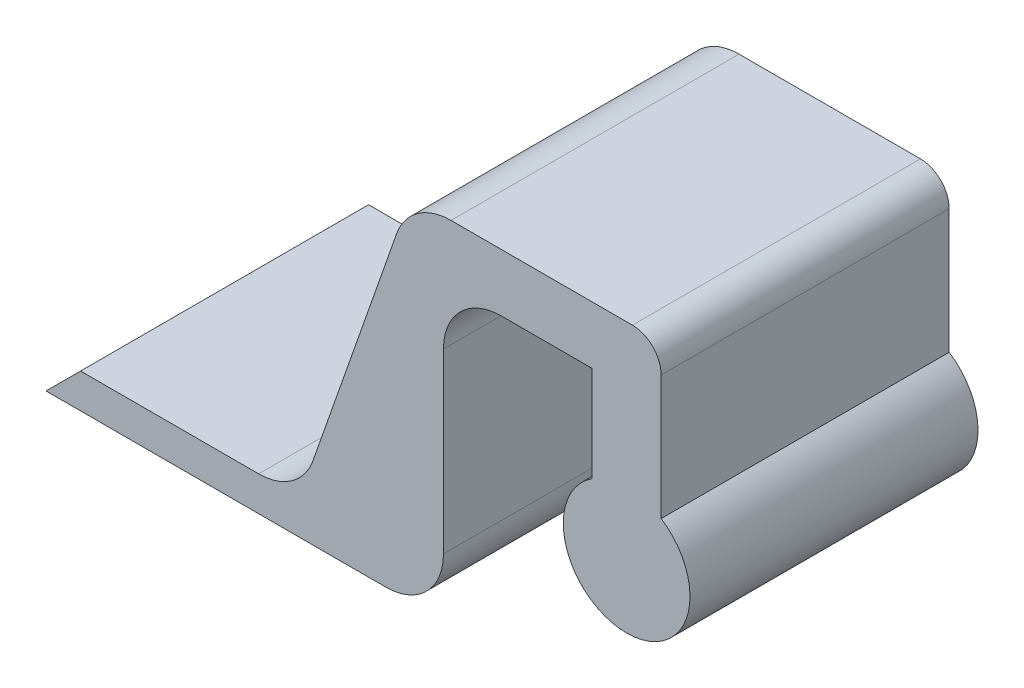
ISO-10303-21;
HEADER;
FILE_DESCRIPTION(('STEP AP214'),'2;1');
FILE_NAME('part.step','',(''),(''),'','','');
FILE_SCHEMA(('AUTOMOTIVE_DESIGN { 1 0 10303 214 1 1 1 1 }'));
ENDSEC;
DATA;
#1=APPLICATION_CONTEXT('core data for automotive mechanical design processes');
#2=APPLICATION_PROTOCOL_DEFINITION('international standard','automotive_design',2000,#1);
#3=PRODUCT_CONTEXT('',#1,'mechanical');
#4=PRODUCT('Part','Part','',(#3));
#5=PRODUCT_RELATED_PRODUCT_CATEGORY('part','',(#4));
#6=PRODUCT_DEFINITION_FORMATION('','',#4);
#7=PRODUCT_DEFINITION_CONTEXT('part definition',#1,'design');
#8=PRODUCT_DEFINITION('design','',#6,#7);
#9=PRODUCT_DEFINITION_SHAPE('','',#8);
#10=(LENGTH_UNIT() NAMED_UNIT(*) SI_UNIT(.MILLI.,.METRE.));
#11=(NAMED_UNIT(*) PLANE_ANGLE_UNIT() SI_UNIT($,.RADIAN.));
#12=(NAMED_UNIT(*) SI_UNIT($,.STERADIAN.) SOLID_ANGLE_UNIT());
#13=UNCERTAINTY_MEASURE_WITH_UNIT(LENGTH_MEASURE(1.E-05),#10,'distance_accuracy_value','');
#14=(GEOMETRIC_REPRESENTATION_CONTEXT(3) GLOBAL_UNCERTAINTY_ASSIGNED_CONTEXT((#13)) GLOBAL_UNIT_ASSIGNED_CONTEXT((#10,
#11,#12)) REPRESENTATION_CONTEXT('',''));
#15=CARTESIAN_POINT('',(0.,0.,0.));
#16=DIRECTION('',(0.,0.,1.));
#17=DIRECTION('',(1.,0.,0.));
#18=AXIS2_PLACEMENT_3D('',#15,#16,#17);
#19=CARTESIAN_POINT('',(-31.9445655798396,-4.50000000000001,25.));
#20=DIRECTION('',(0.,0.,-0.999999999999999));
#21=DIRECTION('',(-0.999999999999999,0.,0.));
#22=AXIS2_PLACEMENT_3D('',#19,#20,#21);
#23=CYLINDRICAL_SURFACE('',#22,5.);
#24=DIRECTION('',(0.,0.,0.999999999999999));
#25=VECTOR('',#24,1.);
#26=CARTESIAN_POINT('',(-27.226523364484,-6.15531799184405,25.));
#27=LINE('',#26,#25);
#28=CARTESIAN_POINT('',(-27.226523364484,-6.15531799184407,0.));
#29=VERTEX_POINT('',#28);
#30=CARTESIAN_POINT('',(-27.2265233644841,-6.15531799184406,25.));
#31=VERTEX_POINT('',#30);
#32=EDGE_CURVE('E178',#29,#31,#27,.T.);
#33=ORIENTED_EDGE('',*,*,#32,.F.);
#34=CARTESIAN_POINT('',(-31.9445655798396,-4.5,0.));
#35=DIRECTION('',(0.,0.,0.999999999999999));
#36=DIRECTION('',(0.999999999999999,0.,0.));
#37=AXIS2_PLACEMENT_3D('',#34,#35,#36);
#38=CIRCLE('',#37,5.);
#39=CARTESIAN_POINT('',(-31.9445655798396,-9.50000000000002,0.));
#40=VERTEX_POINT('',#39);
#41=EDGE_CURVE('E276',#29,#40,#38,.F.);
#42=ORIENTED_EDGE('',*,*,#41,.T.);
#43=DIRECTION('',(0.,0.,0.999999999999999));
#44=VECTOR('',#43,1.);
#45=CARTESIAN_POINT('',(-31.9445655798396,-9.50000000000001,25.));
#46=LINE('',#45,#44);
#47=CARTESIAN_POINT('',(-31.9445655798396,-9.50000000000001,25.));
#48=VERTEX_POINT('',#47);
#49=EDGE_CURVE('E272',#48,#40,#46,.F.);
#50=ORIENTED_EDGE('',*,*,#49,.F.);
#51=CARTESIAN_POINT('',(-31.9445655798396,-4.50000000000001,25.));
#52=DIRECTION('',(0.,0.,0.999999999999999));
#53=DIRECTION('',(0.999999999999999,0.,0.));
#54=AXIS2_PLACEMENT_3D('',#51,#52,#53);
#55=CIRCLE('',#54,5.);
#56=EDGE_CURVE('E279',#48,#31,#55,.T.);
#57=ORIENTED_EDGE('',*,*,#56,.T.);
#58=EDGE_LOOP('',(#33,#42,#50,#57));
#59=FACE_BOUND('',#58,.T.);
#60=ADVANCED_FACE('F60',(#59),#23,.F.);
#61=CARTESIAN_POINT('',(-3.,0.,25.));
#62=DIRECTION('',(-0.999999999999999,0.,0.));
#63=DIRECTION('',(0.,0.,0.999999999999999));
#64=AXIS2_PLACEMENT_3D('',#61,#62,#63);
#65=PLANE('',#64);
#66=DIRECTION('',(0.,1.,0.));
#67=VECTOR('',#66,1.);
#68=CARTESIAN_POINT('',(-3.,0.,0.));
#69=LINE('',#68,#67);
#70=CARTESIAN_POINT('',(-3.,4.60977222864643,0.));
#71=VERTEX_POINT('',#70);
#72=CARTESIAN_POINT('',(-2.99999999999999,12.9,0.));
#73=VERTEX_POINT('',#72);
#74=EDGE_CURVE('E173',#71,#73,#69,.T.);
#75=ORIENTED_EDGE('',*,*,#74,.F.);
#76=DIRECTION('',(0.,0.,-0.999999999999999));
#77=VECTOR('',#76,1.);
#78=CARTESIAN_POINT('',(-2.99999999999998,4.60977222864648,25.));
#79=LINE('',#78,#77);
#80=CARTESIAN_POINT('',(-2.99999999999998,4.60977222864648,25.));
#81=VERTEX_POINT('',#80);
#82=EDGE_CURVE('E166',#81,#71,#79,.T.);
#83=ORIENTED_EDGE('',*,*,#82,.F.);
#84=DIRECTION('',(0.,1.,0.));
#85=VECTOR('',#84,1.);
#86=CARTESIAN_POINT('',(-3.,0.,25.));
#87=LINE('',#86,#85);
#88=CARTESIAN_POINT('',(-3.00000000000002,12.9,25.));
#89=VERTEX_POINT('',#88);
#90=EDGE_CURVE('E170',#81,#89,#87,.T.);
#91=ORIENTED_EDGE('',*,*,#90,.T.);
#92=DIRECTION('',(0.,0.,-0.999999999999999));
#93=VECTOR('',#92,1.);
#94=CARTESIAN_POINT('',(-3.00000000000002,12.9,25.));
#95=LINE('',#94,#93);
#96=EDGE_CURVE('E228',#89,#73,#95,.T.);
#97=ORIENTED_EDGE('',*,*,#96,.T.);
#98=EDGE_LOOP('',(#75,#83,#91,#97));
#99=FACE_BOUND('',#98,.T.);
#100=ADVANCED_FACE('F168',(#99),#65,.T.);
#101=CARTESIAN_POINT('',(0.,0.,25.));
#102=DIRECTION('',(0.,0.,-0.999999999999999));
#103=DIRECTION('',(-0.999999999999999,0.,0.));
#104=AXIS2_PLACEMENT_3D('',#101,#102,#103);
#105=CYLINDRICAL_SURFACE('',#104,5.5);
#106=CARTESIAN_POINT('',(0.,0.,0.));
#107=DIRECTION('',(0.,0.,0.999999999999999));
#108=DIRECTION('',(0.999999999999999,0.,0.));
#109=AXIS2_PLACEMENT_3D('',#106,#107,#108);
#110=CIRCLE('',#109,5.5);
#111=CARTESIAN_POINT('',(2.99999999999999,4.60977222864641,0.));
#112=VERTEX_POINT('',#111);
#113=EDGE_CURVE('E231',#71,#112,#110,.T.);
#114=ORIENTED_EDGE('',*,*,#113,.T.);
#115=DIRECTION('',(0.,0.,-0.999999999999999));
#116=VECTOR('',#115,1.);
#117=CARTESIAN_POINT('',(3.,4.60977222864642,25.));
#118=LINE('',#117,#116);
#119=CARTESIAN_POINT('',(3.,4.60977222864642,25.));
#120=VERTEX_POINT('',#119);
#121=EDGE_CURVE('E179',#120,#112,#118,.T.);
#122=ORIENTED_EDGE('',*,*,#121,.F.);
#123=CARTESIAN_POINT('',(0.,0.,25.));
#124=DIRECTION('',(0.,0.,0.999999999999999));
#125=DIRECTION('',(0.999999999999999,0.,0.));
#126=AXIS2_PLACEMENT_3D('',#123,#124,#125);
#127=CIRCLE('',#126,5.5);
#128=EDGE_CURVE('E183',#81,#120,#127,.T.);
#129=ORIENTED_EDGE('',*,*,#128,.F.);
#130=ORIENTED_EDGE('',*,*,#82,.T.);
#131=EDGE_LOOP('',(#114,#122,#129,#130));
#132=FACE_BOUND('',#131,.T.);
#133=ADVANCED_FACE('F184',(#132),#105,.T.);
#134=CARTESIAN_POINT('',(3.,0.,25.));
#135=DIRECTION('',(0.999999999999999,0.,0.));
#136=DIRECTION('',(0.,0.,-0.999999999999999));
#137=AXIS2_PLACEMENT_3D('',#134,#135,#136);
#138=PLANE('',#137);
#139=DIRECTION('',(0.,-1.,0.));
#140=VECTOR('',#139,1.);
#141=CARTESIAN_POINT('',(2.99999999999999,0.,0.));
#142=LINE('',#141,#140);
#143=CARTESIAN_POINT('',(2.99999999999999,15.4,0.));
#144=VERTEX_POINT('',#143);
#145=EDGE_CURVE('E234',#144,#112,#142,.T.);
#146=ORIENTED_EDGE('',*,*,#145,.F.);
#147=DIRECTION('',(0.,0.,-0.999999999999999));
#148=VECTOR('',#147,1.);
#149=CARTESIAN_POINT('',(3.,15.4,25.));
#150=LINE('',#149,#148);
#151=CARTESIAN_POINT('',(3.,15.4,25.));
#152=VERTEX_POINT('',#151);
#153=EDGE_CURVE('E316',#144,#152,#150,.F.);
#154=ORIENTED_EDGE('',*,*,#153,.T.);
#155=DIRECTION('',(0.,-1.,0.));
#156=VECTOR('',#155,1.);
#157=CARTESIAN_POINT('',(3.,0.,25.));
#158=LINE('',#157,#156);
#159=EDGE_CURVE('E189',#152,#120,#158,.T.);
#160=ORIENTED_EDGE('',*,*,#159,.T.);
#161=ORIENTED_EDGE('',*,*,#121,.T.);
#162=EDGE_LOOP('',(#146,#154,#160,#161));
#163=FACE_BOUND('',#162,.T.);
#164=ADVANCED_FACE('F363',(#163),#138,.T.);
#165=CARTESIAN_POINT('',(0.,17.9,25.));
#166=DIRECTION('',(0.,1.,0.));
#167=DIRECTION('',(0.,0.,0.999999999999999));
#168=AXIS2_PLACEMENT_3D('',#165,#166,#167);
#169=PLANE('',#168);
#170=DIRECTION('',(0.999999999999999,0.,0.));
#171=VECTOR('',#170,1.);
#172=CARTESIAN_POINT('',(0.,17.9,25.));
#173=LINE('',#172,#171);
#174=CARTESIAN_POINT('',(-15.2421857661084,17.9,25.));
#175=VERTEX_POINT('',#174);
#176=CARTESIAN_POINT('',(0.5,17.9,25.));
#177=VERTEX_POINT('',#176);
#178=EDGE_CURVE('E204',#175,#177,#173,.T.);
#179=ORIENTED_EDGE('',*,*,#178,.T.);
#180=DIRECTION('',(0.,0.,-0.999999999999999));
#181=VECTOR('',#180,1.);
#182=CARTESIAN_POINT('',(0.5,17.9,25.));
#183=LINE('',#182,#181);
#184=CARTESIAN_POINT('',(0.500000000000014,17.9,0.));
#185=VERTEX_POINT('',#184);
#186=EDGE_CURVE('E309',#177,#185,#183,.T.);
#187=ORIENTED_EDGE('',*,*,#186,.T.);
#188=DIRECTION('',(0.999999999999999,0.,0.));
#189=VECTOR('',#188,1.);
#190=CARTESIAN_POINT('',(0.,17.9,0.));
#191=LINE('',#190,#189);
#192=CARTESIAN_POINT('',(-15.2421857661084,17.9,0.));
#193=VERTEX_POINT('',#192);
#194=EDGE_CURVE('E237',#193,#185,#191,.T.);
#195=ORIENTED_EDGE('',*,*,#194,.F.);
#196=DIRECTION('',(0.,0.,-0.999999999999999));
#197=VECTOR('',#196,1.);
#198=CARTESIAN_POINT('',(-15.2421857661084,17.9,25.));
#199=LINE('',#198,#197);
#200=EDGE_CURVE('E303',#193,#175,#199,.F.);
#201=ORIENTED_EDGE('',*,*,#200,.T.);
#202=EDGE_LOOP('',(#179,#187,#195,#201));
#203=FACE_BOUND('',#202,.T.);
#204=ADVANCED_FACE('F371',(#203),#169,.T.);
#205=CARTESIAN_POINT('',(-22.3195249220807,7.83077163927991,25.));
#206=DIRECTION('',(-0.943608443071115,0.33106359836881,0.));
#207=DIRECTION('',(-0.33106359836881,-0.943608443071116,0.));
#208=AXIS2_PLACEMENT_3D('',#205,#206,#207);
#209=PLANE('',#208);
#210=DIRECTION('',(0.33106359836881,0.943608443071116,0.));
#211=VECTOR('',#210,1.);
#212=CARTESIAN_POINT('',(-22.3195249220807,7.83077163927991,25.));
#213=LINE('',#212,#211);
#214=CARTESIAN_POINT('',(-19.960227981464,14.555317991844,25.));
#215=VERTEX_POINT('',#214);
#216=EDGE_CURVE('E208',#31,#215,#213,.T.);
#217=ORIENTED_EDGE('',*,*,#216,.T.);
#218=DIRECTION('',(0.,0.,-0.999999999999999));
#219=VECTOR('',#218,1.);
#220=CARTESIAN_POINT('',(-19.960227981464,14.555317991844,25.));
#221=LINE('',#220,#219);
#222=CARTESIAN_POINT('',(-19.960227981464,14.555317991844,0.));
#223=VERTEX_POINT('',#222);
#224=EDGE_CURVE('E296',#215,#223,#221,.T.);
#225=ORIENTED_EDGE('',*,*,#224,.T.);
#226=DIRECTION('',(0.33106359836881,0.943608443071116,0.));
#227=VECTOR('',#226,1.);
#228=CARTESIAN_POINT('',(-22.3195249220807,7.83077163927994,0.));
#229=LINE('',#228,#227);
#230=EDGE_CURVE('E241',#29,#223,#229,.T.);
#231=ORIENTED_EDGE('',*,*,#230,.F.);
#232=ORIENTED_EDGE('',*,*,#32,.T.);
#233=EDGE_LOOP('',(#217,#225,#231,#232));
#234=FACE_BOUND('',#233,.T.);
#235=ADVANCED_FACE('F379',(#234),#209,.T.);
#236=CARTESIAN_POINT('',(0.,-9.50000000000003,25.));
#237=DIRECTION('',(0.,1.,0.));
#238=DIRECTION('',(0.,0.,0.999999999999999));
#239=AXIS2_PLACEMENT_3D('',#236,#237,#238);
#240=PLANE('',#239);
#241=DIRECTION('',(0.999999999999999,0.,0.));
#242=VECTOR('',#241,1.);
#243=CARTESIAN_POINT('',(0.,-9.50000000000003,25.));
#244=LINE('',#243,#242);
#245=CARTESIAN_POINT('',(-47.4,-9.50000000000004,25.));
#246=VERTEX_POINT('',#245);
#247=EDGE_CURVE('E212',#246,#48,#244,.T.);
#248=ORIENTED_EDGE('',*,*,#247,.T.);
#249=ORIENTED_EDGE('',*,*,#49,.T.);
#250=DIRECTION('',(0.999999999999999,0.,0.));
#251=VECTOR('',#250,1.);
#252=CARTESIAN_POINT('',(0.,-9.50000000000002,0.));
#253=LINE('',#252,#251);
#254=CARTESIAN_POINT('',(-47.4,-9.50000000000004,0.));
#255=VERTEX_POINT('',#254);
#256=EDGE_CURVE('E245',#255,#40,#253,.T.);
#257=ORIENTED_EDGE('',*,*,#256,.F.);
#258=DIRECTION('',(0.,0.,-0.999999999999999));
#259=VECTOR('',#258,1.);
#260=CARTESIAN_POINT('',(-47.4,-9.50000000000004,25.));
#261=LINE('',#260,#259);
#262=EDGE_CURVE('E264',#246,#255,#261,.T.);
#263=ORIENTED_EDGE('',*,*,#262,.F.);
#264=EDGE_LOOP('',(#248,#249,#257,#263));
#265=FACE_BOUND('',#264,.T.);
#266=ADVANCED_FACE('F388',(#265),#240,.T.);
#267=CARTESIAN_POINT('',(-18.95,18.95,25.));
#268=DIRECTION('',(-0.707106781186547,0.707106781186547,0.));
#269=DIRECTION('',(-0.707106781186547,-0.707106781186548,0.));
#270=AXIS2_PLACEMENT_3D('',#267,#268,#269);
#271=PLANE('',#270);
#272=DIRECTION('',(0.707106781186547,0.707106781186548,0.));
#273=VECTOR('',#272,1.);
#274=CARTESIAN_POINT('',(-18.95,18.95,0.));
#275=LINE('',#274,#273);
#276=CARTESIAN_POINT('',(-50.3999999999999,-12.5,0.));
#277=VERTEX_POINT('',#276);
#278=EDGE_CURVE('E249',#277,#255,#275,.T.);
#279=ORIENTED_EDGE('',*,*,#278,.F.);
#280=DIRECTION('',(0.,0.,-0.999999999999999));
#281=VECTOR('',#280,1.);
#282=CARTESIAN_POINT('',(-50.4,-12.5,25.));
#283=LINE('',#282,#281);
#284=CARTESIAN_POINT('',(-50.4,-12.5,25.));
#285=VERTEX_POINT('',#284);
#286=EDGE_CURVE('E260',#285,#277,#283,.T.);
#287=ORIENTED_EDGE('',*,*,#286,.F.);
#288=DIRECTION('',(0.707106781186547,0.707106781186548,0.));
#289=VECTOR('',#288,1.);
#290=CARTESIAN_POINT('',(-18.95,18.95,25.));
#291=LINE('',#290,#289);
#292=EDGE_CURVE('E216',#285,#246,#291,.T.);
#293=ORIENTED_EDGE('',*,*,#292,.T.);
#294=ORIENTED_EDGE('',*,*,#262,.T.);
#295=EDGE_LOOP('',(#279,#287,#293,#294));
#296=FACE_BOUND('',#295,.T.);
#297=ADVANCED_FACE('F391',(#296),#271,.T.);
#298=CARTESIAN_POINT('',(0.,-12.5,25.));
#299=DIRECTION('',(0.,-1.,0.));
#300=DIRECTION('',(0.999999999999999,0.,0.));
#301=AXIS2_PLACEMENT_3D('',#298,#299,#300);
#302=PLANE('',#301);
#303=DIRECTION('',(-0.999999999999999,0.,0.));
#304=VECTOR('',#303,1.);
#305=CARTESIAN_POINT('',(0.,-12.5,0.));
#306=LINE('',#305,#304);
#307=CARTESIAN_POINT('',(-20.9,-12.5,0.));
#308=VERTEX_POINT('',#307);
#309=EDGE_CURVE('E253',#308,#277,#306,.T.);
#310=ORIENTED_EDGE('',*,*,#309,.F.);
#311=DIRECTION('',(0.,0.,-0.999999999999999));
#312=VECTOR('',#311,1.);
#313=CARTESIAN_POINT('',(-20.9,-12.5,25.));
#314=LINE('',#313,#312);
#315=CARTESIAN_POINT('',(-20.9,-12.5,25.));
#316=VERTEX_POINT('',#315);
#317=EDGE_CURVE('E289',#308,#316,#314,.F.);
#318=ORIENTED_EDGE('',*,*,#317,.T.);
#319=DIRECTION('',(-0.999999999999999,0.,0.));
#320=VECTOR('',#319,1.);
#321=CARTESIAN_POINT('',(0.,-12.5,25.));
#322=LINE('',#321,#320);
#323=EDGE_CURVE('E220',#316,#285,#322,.T.);
#324=ORIENTED_EDGE('',*,*,#323,.T.);
#325=ORIENTED_EDGE('',*,*,#286,.T.);
#326=EDGE_LOOP('',(#310,#318,#324,#325));
#327=FACE_BOUND('',#326,.T.);
#328=ADVANCED_FACE('F501',(#327),#302,.T.);
#329=CARTESIAN_POINT('',(-15.9,0.,25.));
#330=DIRECTION('',(0.999999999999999,0.,0.));
#331=DIRECTION('',(0.,1.,0.));
#332=AXIS2_PLACEMENT_3D('',#329,#330,#331);
#333=PLANE('',#332);
#334=DIRECTION('',(0.,-1.,0.));
#335=VECTOR('',#334,1.);
#336=CARTESIAN_POINT('',(-15.9,0.,0.));
#337=LINE('',#336,#335);
#338=CARTESIAN_POINT('',(-15.9,7.89999999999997,0.));
#339=VERTEX_POINT('',#338);
#340=CARTESIAN_POINT('',(-15.9,-7.50000000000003,0.));
#341=VERTEX_POINT('',#340);
#342=EDGE_CURVE('E199',#339,#341,#337,.T.);
#343=ORIENTED_EDGE('',*,*,#342,.F.);
#344=DIRECTION('',(0.,0.,-0.999999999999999));
#345=VECTOR('',#344,1.);
#346=CARTESIAN_POINT('',(-15.9,7.89999999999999,25.));
#347=LINE('',#346,#345);
#348=CARTESIAN_POINT('',(-15.9,7.89999999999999,25.));
#349=VERTEX_POINT('',#348);
#350=EDGE_CURVE('E82',#339,#349,#347,.F.);
#351=ORIENTED_EDGE('',*,*,#350,.T.);
#352=DIRECTION('',(0.,-1.,0.));
#353=VECTOR('',#352,1.);
#354=CARTESIAN_POINT('',(-15.9,0.,25.));
#355=LINE('',#354,#353);
#356=CARTESIAN_POINT('',(-15.9,-7.50000000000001,25.));
#357=VERTEX_POINT('',#356);
#358=EDGE_CURVE('E223',#349,#357,#355,.T.);
#359=ORIENTED_EDGE('',*,*,#358,.T.);
#360=DIRECTION('',(0.,0.,-0.999999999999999));
#361=VECTOR('',#360,1.);
#362=CARTESIAN_POINT('',(-15.9,-7.50000000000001,25.));
#363=LINE('',#362,#361);
#364=EDGE_CURVE('E282',#357,#341,#363,.T.);
#365=ORIENTED_EDGE('',*,*,#364,.T.);
#366=EDGE_LOOP('',(#343,#351,#359,#365));
#367=FACE_BOUND('',#366,.T.);
#368=ADVANCED_FACE('F401',(#367),#333,.T.);
#369=CARTESIAN_POINT('',(0.,12.9,25.));
#370=DIRECTION('',(0.,-1.,0.));
#371=DIRECTION('',(0.,0.,-0.999999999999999));
#372=AXIS2_PLACEMENT_3D('',#369,#370,#371);
#373=PLANE('',#372);
#374=DIRECTION('',(-0.999999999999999,0.,0.));
#375=VECTOR('',#374,1.);
#376=CARTESIAN_POINT('',(0.,12.9,25.));
#377=LINE('',#376,#375);
#378=CARTESIAN_POINT('',(-10.9,12.9,25.));
#379=VERTEX_POINT('',#378);
#380=EDGE_CURVE('E193',#89,#379,#377,.T.);
#381=ORIENTED_EDGE('',*,*,#380,.T.);
#382=DIRECTION('',(0.,0.,-0.999999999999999));
#383=VECTOR('',#382,1.);
#384=CARTESIAN_POINT('',(-10.9,12.9,0.));
#385=LINE('',#384,#383);
#386=CARTESIAN_POINT('',(-10.9,12.9,0.));
#387=VERTEX_POINT('',#386);
#388=EDGE_CURVE('E322',#379,#387,#385,.T.);
#389=ORIENTED_EDGE('',*,*,#388,.T.);
#390=DIRECTION('',(-0.999999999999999,0.,0.));
#391=VECTOR('',#390,1.);
#392=CARTESIAN_POINT('',(0.,12.9,0.));
#393=LINE('',#392,#391);
#394=EDGE_CURVE('E195',#73,#387,#393,.T.);
#395=ORIENTED_EDGE('',*,*,#394,.F.);
#396=ORIENTED_EDGE('',*,*,#96,.F.);
#397=EDGE_LOOP('',(#381,#389,#395,#396));
#398=FACE_BOUND('',#397,.T.);
#399=ADVANCED_FACE('F356',(#398),#373,.T.);
#400=CARTESIAN_POINT('',(0.,0.,25.));
#401=DIRECTION('',(0.,0.,0.999999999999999));
#402=DIRECTION('',(0.999999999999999,0.,0.));
#403=AXIS2_PLACEMENT_3D('',#400,#401,#402);
#404=PLANE('',#403);
#405=ORIENTED_EDGE('',*,*,#159,.F.);
#406=CARTESIAN_POINT('',(0.5,15.4,25.));
#407=DIRECTION('',(0.,0.,0.999999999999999));
#408=DIRECTION('',(0.999999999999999,0.,0.));
#409=AXIS2_PLACEMENT_3D('',#406,#407,#408);
#410=CIRCLE('',#409,2.5);
#411=EDGE_CURVE('E319',#152,#177,#410,.T.);
#412=ORIENTED_EDGE('',*,*,#411,.T.);
#413=ORIENTED_EDGE('',*,*,#178,.F.);
#414=CARTESIAN_POINT('',(-15.2421857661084,12.9,25.));
#415=DIRECTION('',(0.,0.,0.999999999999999));
#416=DIRECTION('',(0.999999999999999,0.,0.));
#417=AXIS2_PLACEMENT_3D('',#414,#415,#416);
#418=CIRCLE('',#417,5.);
#419=EDGE_CURVE('E306',#175,#215,#418,.T.);
#420=ORIENTED_EDGE('',*,*,#419,.T.);
#421=ORIENTED_EDGE('',*,*,#216,.F.);
#422=ORIENTED_EDGE('',*,*,#56,.F.);
#423=ORIENTED_EDGE('',*,*,#247,.F.);
#424=ORIENTED_EDGE('',*,*,#292,.F.);
#425=ORIENTED_EDGE('',*,*,#323,.F.);
#426=CARTESIAN_POINT('',(-20.9,-7.50000000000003,25.));
#427=DIRECTION('',(0.,0.,0.999999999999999));
#428=DIRECTION('',(0.999999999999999,0.,0.));
#429=AXIS2_PLACEMENT_3D('',#426,#427,#428);
#430=CIRCLE('',#429,5.);
#431=EDGE_CURVE('E292',#316,#357,#430,.T.);
#432=ORIENTED_EDGE('',*,*,#431,.T.);
#433=ORIENTED_EDGE('',*,*,#358,.F.);
#434=CARTESIAN_POINT('',(-10.9,7.9,25.));
#435=DIRECTION('',(0.,0.,0.999999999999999));
#436=DIRECTION('',(0.999999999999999,0.,0.));
#437=AXIS2_PLACEMENT_3D('',#434,#435,#436);
#438=CIRCLE('',#437,5.);
#439=EDGE_CURVE('E13',#349,#379,#438,.F.);
#440=ORIENTED_EDGE('',*,*,#439,.T.);
#441=ORIENTED_EDGE('',*,*,#380,.F.);
#442=ORIENTED_EDGE('',*,*,#90,.F.);
#443=ORIENTED_EDGE('',*,*,#128,.T.);
#444=EDGE_LOOP('',(#405,#412,#413,#420,#421,#422,#423,#424,#425,#432,#433,#440,#441,#442,#443));
#445=FACE_BOUND('',#444,.T.);
#446=ADVANCED_FACE('F191',(#445),#404,.T.);
#447=CARTESIAN_POINT('',(0.,0.,0.));
#448=DIRECTION('',(0.,0.,0.999999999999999));
#449=DIRECTION('',(0.999999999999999,0.,0.));
#450=AXIS2_PLACEMENT_3D('',#447,#448,#449);
#451=PLANE('',#450);
#452=ORIENTED_EDGE('',*,*,#194,.T.);
#453=CARTESIAN_POINT('',(0.499999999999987,15.4,0.));
#454=DIRECTION('',(0.,0.,0.999999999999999));
#455=DIRECTION('',(0.999999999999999,0.,0.));
#456=AXIS2_PLACEMENT_3D('',#453,#454,#455);
#457=CIRCLE('',#456,2.5);
#458=EDGE_CURVE('E313',#185,#144,#457,.F.);
#459=ORIENTED_EDGE('',*,*,#458,.T.);
#460=ORIENTED_EDGE('',*,*,#145,.T.);
#461=ORIENTED_EDGE('',*,*,#113,.F.);
#462=ORIENTED_EDGE('',*,*,#74,.T.);
#463=ORIENTED_EDGE('',*,*,#394,.T.);
#464=CARTESIAN_POINT('',(-10.9,7.89999999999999,0.));
#465=DIRECTION('',(0.,0.,0.999999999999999));
#466=DIRECTION('',(0.999999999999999,0.,0.));
#467=AXIS2_PLACEMENT_3D('',#464,#465,#466);
#468=CIRCLE('',#467,5.);
#469=EDGE_CURVE('E69',#387,#339,#468,.T.);
#470=ORIENTED_EDGE('',*,*,#469,.T.);
#471=ORIENTED_EDGE('',*,*,#342,.T.);
#472=CARTESIAN_POINT('',(-20.9,-7.50000000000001,0.));
#473=DIRECTION('',(0.,0.,0.999999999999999));
#474=DIRECTION('',(0.999999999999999,0.,0.));
#475=AXIS2_PLACEMENT_3D('',#472,#473,#474);
#476=CIRCLE('',#475,5.);
#477=EDGE_CURVE('E286',#341,#308,#476,.F.);
#478=ORIENTED_EDGE('',*,*,#477,.T.);
#479=ORIENTED_EDGE('',*,*,#309,.T.);
#480=ORIENTED_EDGE('',*,*,#278,.T.);
#481=ORIENTED_EDGE('',*,*,#256,.T.);
#482=ORIENTED_EDGE('',*,*,#41,.F.);
#483=ORIENTED_EDGE('',*,*,#230,.T.);
#484=CARTESIAN_POINT('',(-15.2421857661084,12.9,0.));
#485=DIRECTION('',(0.,0.,0.999999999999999));
#486=DIRECTION('',(0.999999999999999,0.,0.));
#487=AXIS2_PLACEMENT_3D('',#484,#485,#486);
#488=CIRCLE('',#487,5.);
#489=EDGE_CURVE('E300',#223,#193,#488,.F.);
#490=ORIENTED_EDGE('',*,*,#489,.T.);
#491=EDGE_LOOP('',(#452,#459,#460,#461,#462,#463,#470,#471,#478,#479,#480,#481,#482,#483,#490));
#492=FACE_BOUND('',#491,.T.);
#493=ADVANCED_FACE('F359',(#492),#451,.F.);
#494=CARTESIAN_POINT('',(-20.9,-7.50000000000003,25.));
#495=DIRECTION('',(0.,0.,-0.999999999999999));
#496=DIRECTION('',(-0.999999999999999,0.,0.));
#497=AXIS2_PLACEMENT_3D('',#494,#495,#496);
#498=CYLINDRICAL_SURFACE('',#497,5.);
#499=ORIENTED_EDGE('',*,*,#431,.F.);
#500=ORIENTED_EDGE('',*,*,#317,.F.);
#501=ORIENTED_EDGE('',*,*,#477,.F.);
#502=ORIENTED_EDGE('',*,*,#364,.F.);
#503=EDGE_LOOP('',(#499,#500,#501,#502));
#504=FACE_BOUND('',#503,.T.);
#505=ADVANCED_FACE('F399',(#504),#498,.T.);
#506=CARTESIAN_POINT('',(-15.2421857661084,12.9,25.));
#507=DIRECTION('',(0.,0.,-0.999999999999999));
#508=DIRECTION('',(-0.999999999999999,0.,0.));
#509=AXIS2_PLACEMENT_3D('',#506,#507,#508);
#510=CYLINDRICAL_SURFACE('',#509,5.);
#511=ORIENTED_EDGE('',*,*,#419,.F.);
#512=ORIENTED_EDGE('',*,*,#200,.F.);
#513=ORIENTED_EDGE('',*,*,#489,.F.);
#514=ORIENTED_EDGE('',*,*,#224,.F.);
#515=EDGE_LOOP('',(#511,#512,#513,#514));
#516=FACE_BOUND('',#515,.T.);
#517=ADVANCED_FACE('F377',(#516),#510,.T.);
#518=CARTESIAN_POINT('',(0.5,15.4,25.));
#519=DIRECTION('',(0.,0.,-0.999999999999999));
#520=DIRECTION('',(-0.999999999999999,0.,0.));
#521=AXIS2_PLACEMENT_3D('',#518,#519,#520);
#522=CYLINDRICAL_SURFACE('',#521,2.5);
#523=ORIENTED_EDGE('',*,*,#411,.F.);
#524=ORIENTED_EDGE('',*,*,#153,.F.);
#525=ORIENTED_EDGE('',*,*,#458,.F.);
#526=ORIENTED_EDGE('',*,*,#186,.F.);
#527=EDGE_LOOP('',(#523,#524,#525,#526));
#528=FACE_BOUND('',#527,.T.);
#529=ADVANCED_FACE('F368',(#528),#522,.T.);
#530=CARTESIAN_POINT('',(-10.9,7.9,25.));
#531=DIRECTION('',(0.,0.,0.999999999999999));
#532=DIRECTION('',(0.999999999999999,0.,0.));
#533=AXIS2_PLACEMENT_3D('',#530,#531,#532);
#534=CYLINDRICAL_SURFACE('',#533,5.);
#535=ORIENTED_EDGE('',*,*,#439,.F.);
#536=ORIENTED_EDGE('',*,*,#350,.F.);
#537=ORIENTED_EDGE('',*,*,#469,.F.);
#538=ORIENTED_EDGE('',*,*,#388,.F.);
#539=EDGE_LOOP('',(#535,#536,#537,#538));
#540=FACE_BOUND('',#539,.T.);
#541=ADVANCED_FACE('F62',(#540),#534,.F.);
#542=CLOSED_SHELL('',(#60,#100,#133,#164,#204,#235,#266,#297,#328,#368,#399,#446,#493,#505,#517,
#529,#541));
#543=MANIFOLD_SOLID_BREP('B2',#542);
#544=ADVANCED_BREP_SHAPE_REPRESENTATION('',(#18,#543),#14);
#545=SHAPE_DEFINITION_REPRESENTATION(#9,#544);
ENDSEC;
END-ISO-10303-21;
